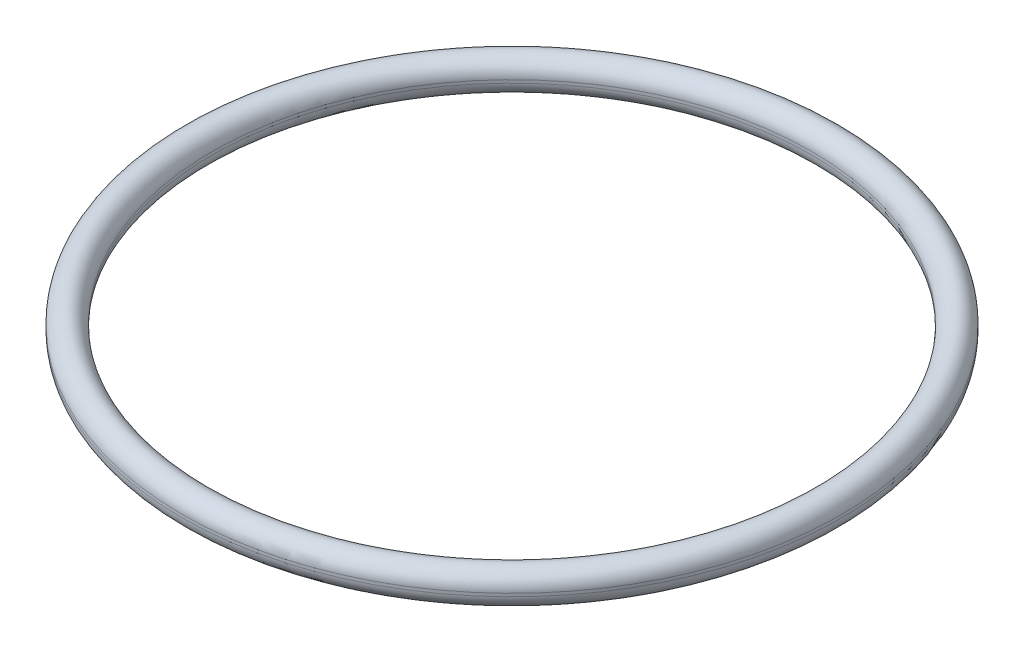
ISO-10303-21;
HEADER;
FILE_DESCRIPTION(('STEP AP214'),'2;1');
FILE_NAME('part.step','',(''),(''),'','','');
FILE_SCHEMA(('AUTOMOTIVE_DESIGN { 1 0 10303 214 1 1 1 1 }'));
ENDSEC;
DATA;
#1=APPLICATION_CONTEXT('core data for automotive mechanical design processes');
#2=APPLICATION_PROTOCOL_DEFINITION('international standard','automotive_design',2000,#1);
#3=PRODUCT_CONTEXT('',#1,'mechanical');
#4=PRODUCT('Part','Part','',(#3));
#5=PRODUCT_RELATED_PRODUCT_CATEGORY('part','',(#4));
#6=PRODUCT_DEFINITION_FORMATION('','',#4);
#7=PRODUCT_DEFINITION_CONTEXT('part definition',#1,'design');
#8=PRODUCT_DEFINITION('design','',#6,#7);
#9=PRODUCT_DEFINITION_SHAPE('','',#8);
#10=(LENGTH_UNIT() NAMED_UNIT(*) SI_UNIT(.MILLI.,.METRE.));
#11=(NAMED_UNIT(*) PLANE_ANGLE_UNIT() SI_UNIT($,.RADIAN.));
#12=(NAMED_UNIT(*) SI_UNIT($,.STERADIAN.) SOLID_ANGLE_UNIT());
#13=UNCERTAINTY_MEASURE_WITH_UNIT(LENGTH_MEASURE(1.E-05),#10,'distance_accuracy_value','');
#14=(GEOMETRIC_REPRESENTATION_CONTEXT(3) GLOBAL_UNCERTAINTY_ASSIGNED_CONTEXT((#13)) GLOBAL_UNIT_ASSIGNED_CONTEXT((#10,
#11,#12)) REPRESENTATION_CONTEXT('',''));
#15=CARTESIAN_POINT('',(0.,0.,0.));
#16=DIRECTION('',(0.,0.,1.));
#17=DIRECTION('',(1.,0.,0.));
#18=AXIS2_PLACEMENT_3D('',#15,#16,#17);
#19=CARTESIAN_POINT('',(0.,0.,0.));
#20=DIRECTION('',(0.,-1.,0.));
#21=DIRECTION('',(0.,0.,-1.));
#22=AXIS2_PLACEMENT_3D('',#19,#20,#21);
#23=TOROIDAL_SURFACE('',#22,13.30325,0.634999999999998);
#24=CARTESIAN_POINT('',(0.,0.,0.));
#25=DIRECTION('',(0.,-1.,0.));
#26=DIRECTION('',(0.,0.,-1.));
#27=AXIS2_PLACEMENT_3D('',#24,#25,#26);
#28=CIRCLE('',#27,13.93825);
#29=CARTESIAN_POINT('',(0.,0.,-13.93825));
#30=VERTEX_POINT('',#29);
#31=EDGE_CURVE('E42',#30,#30,#28,.T.);
#32=ORIENTED_EDGE('',*,*,#31,.T.);
#33=EDGE_LOOP('',(#32));
#34=FACE_BOUND('',#33,.T.);
#35=CARTESIAN_POINT('',(0.,0.,0.));
#36=DIRECTION('',(0.,-1.,0.));
#37=DIRECTION('',(0.,0.,-1.));
#38=AXIS2_PLACEMENT_3D('',#35,#36,#37);
#39=CIRCLE('',#38,12.66825);
#40=CARTESIAN_POINT('',(0.,0.,-12.66825));
#41=VERTEX_POINT('',#40);
#42=EDGE_CURVE('E10',#41,#41,#39,.T.);
#43=ORIENTED_EDGE('',*,*,#42,.F.);
#44=EDGE_LOOP('',(#43));
#45=FACE_BOUND('',#44,.T.);
#46=ADVANCED_FACE('F28',(#34,#45),#23,.T.);
#47=CARTESIAN_POINT('',(0.,0.,0.));
#48=DIRECTION('',(0.,-1.,0.));
#49=DIRECTION('',(0.,0.,-1.));
#50=AXIS2_PLACEMENT_3D('',#47,#48,#49);
#51=CYLINDRICAL_SURFACE('',#50,12.66825);
#52=ORIENTED_EDGE('',*,*,#42,.T.);
#53=EDGE_LOOP('',(#52));
#54=FACE_BOUND('',#53,.T.);
#55=CARTESIAN_POINT('',(0.,0.127,0.));
#56=DIRECTION('',(0.,-1.,0.));
#57=DIRECTION('',(0.,0.,-1.));
#58=AXIS2_PLACEMENT_3D('',#55,#56,#57);
#59=CIRCLE('',#58,12.66825);
#60=CARTESIAN_POINT('',(0.,0.127,-12.66825));
#61=VERTEX_POINT('',#60);
#62=EDGE_CURVE('E34',#61,#61,#59,.T.);
#63=ORIENTED_EDGE('',*,*,#62,.F.);
#64=EDGE_LOOP('',(#63));
#65=FACE_BOUND('',#64,.T.);
#66=ADVANCED_FACE('F58',(#54,#65),#51,.F.);
#67=CARTESIAN_POINT('',(0.,0.127,0.));
#68=DIRECTION('',(0.,-1.,0.));
#69=DIRECTION('',(0.,0.,-1.));
#70=AXIS2_PLACEMENT_3D('',#67,#68,#69);
#71=TOROIDAL_SURFACE('',#70,13.30325,0.635);
#72=ORIENTED_EDGE('',*,*,#62,.T.);
#73=EDGE_LOOP('',(#72));
#74=FACE_BOUND('',#73,.T.);
#75=CARTESIAN_POINT('',(0.,0.127,0.));
#76=DIRECTION('',(0.,-1.,0.));
#77=DIRECTION('',(0.,0.,-1.));
#78=AXIS2_PLACEMENT_3D('',#75,#76,#77);
#79=CIRCLE('',#78,13.93825);
#80=CARTESIAN_POINT('',(0.,0.127,-13.93825));
#81=VERTEX_POINT('',#80);
#82=EDGE_CURVE('E38',#81,#81,#79,.T.);
#83=ORIENTED_EDGE('',*,*,#82,.F.);
#84=EDGE_LOOP('',(#83));
#85=FACE_BOUND('',#84,.T.);
#86=ADVANCED_FACE('F52',(#74,#85),#71,.T.);
#87=CARTESIAN_POINT('',(0.,0.,0.));
#88=DIRECTION('',(0.,-1.,0.));
#89=DIRECTION('',(0.,0.,-1.));
#90=AXIS2_PLACEMENT_3D('',#87,#88,#89);
#91=CYLINDRICAL_SURFACE('',#90,13.93825);
#92=ORIENTED_EDGE('',*,*,#82,.T.);
#93=EDGE_LOOP('',(#92));
#94=FACE_BOUND('',#93,.T.);
#95=ORIENTED_EDGE('',*,*,#31,.F.);
#96=EDGE_LOOP('',(#95));
#97=FACE_BOUND('',#96,.T.);
#98=ADVANCED_FACE('F50',(#94,#97),#91,.T.);
#99=CLOSED_SHELL('',(#46,#66,#86,#98));
#100=MANIFOLD_SOLID_BREP('B2',#99);
#101=ADVANCED_BREP_SHAPE_REPRESENTATION('',(#18,#100),#14);
#102=SHAPE_DEFINITION_REPRESENTATION(#9,#101);
ENDSEC;
END-ISO-10303-21;
